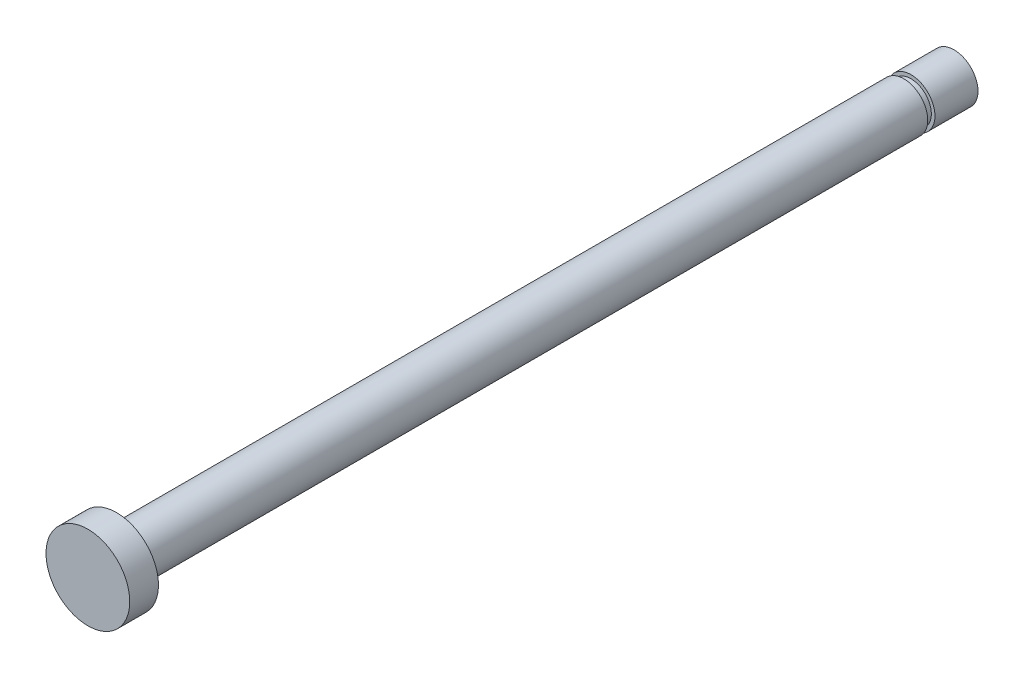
ISO-10303-21;
HEADER;
FILE_DESCRIPTION(('STEP AP214'),'2;1');
FILE_NAME('part.step','',(''),(''),'','','');
FILE_SCHEMA(('AUTOMOTIVE_DESIGN { 1 0 10303 214 1 1 1 1 }'));
ENDSEC;
DATA;
#1=APPLICATION_CONTEXT('core data for automotive mechanical design processes');
#2=APPLICATION_PROTOCOL_DEFINITION('international standard','automotive_design',2000,#1);
#3=PRODUCT_CONTEXT('',#1,'mechanical');
#4=PRODUCT('Part','Part','',(#3));
#5=PRODUCT_RELATED_PRODUCT_CATEGORY('part','',(#4));
#6=PRODUCT_DEFINITION_FORMATION('','',#4);
#7=PRODUCT_DEFINITION_CONTEXT('part definition',#1,'design');
#8=PRODUCT_DEFINITION('design','',#6,#7);
#9=PRODUCT_DEFINITION_SHAPE('','',#8);
#10=(LENGTH_UNIT() NAMED_UNIT(*) SI_UNIT(.MILLI.,.METRE.));
#11=(NAMED_UNIT(*) PLANE_ANGLE_UNIT() SI_UNIT($,.RADIAN.));
#12=(NAMED_UNIT(*) SI_UNIT($,.STERADIAN.) SOLID_ANGLE_UNIT());
#13=UNCERTAINTY_MEASURE_WITH_UNIT(LENGTH_MEASURE(1.E-05),#10,'distance_accuracy_value','');
#14=(GEOMETRIC_REPRESENTATION_CONTEXT(3) GLOBAL_UNCERTAINTY_ASSIGNED_CONTEXT((#13)) GLOBAL_UNIT_ASSIGNED_CONTEXT((#10,
#11,#12)) REPRESENTATION_CONTEXT('',''));
#15=CARTESIAN_POINT('',(0.,0.,0.));
#16=DIRECTION('',(0.,0.,1.));
#17=DIRECTION('',(1.,0.,0.));
#18=AXIS2_PLACEMENT_3D('',#15,#16,#17);
#19=CARTESIAN_POINT('',(0.,0.,-18.1));
#20=DIRECTION('',(0.,0.,-1.));
#21=DIRECTION('',(-1.,0.,0.));
#22=AXIS2_PLACEMENT_3D('',#19,#20,#21);
#23=PLANE('',#22);
#24=CARTESIAN_POINT('',(0.,0.,-18.1));
#25=DIRECTION('',(0.,0.,1.));
#26=DIRECTION('',(1.,0.,0.));
#27=AXIS2_PLACEMENT_3D('',#24,#25,#26);
#28=CIRCLE('',#27,1.);
#29=CARTESIAN_POINT('',(1.,0.,-18.1));
#30=VERTEX_POINT('',#29);
#31=EDGE_CURVE('E18',#30,#30,#28,.T.);
#32=ORIENTED_EDGE('',*,*,#31,.F.);
#33=EDGE_LOOP('',(#32));
#34=FACE_BOUND('',#33,.T.);
#35=ADVANCED_FACE('F15',(#34),#23,.T.);
#36=CARTESIAN_POINT('',(0.,0.,18.1));
#37=DIRECTION('',(0.,0.,1.));
#38=DIRECTION('',(1.,0.,0.));
#39=AXIS2_PLACEMENT_3D('',#36,#37,#38);
#40=CYLINDRICAL_SURFACE('',#39,1.);
#41=CARTESIAN_POINT('',(0.,0.,-16.3));
#42=DIRECTION('',(0.,0.,1.));
#43=DIRECTION('',(1.,0.,0.));
#44=AXIS2_PLACEMENT_3D('',#41,#42,#43);
#45=CIRCLE('',#44,1.);
#46=CARTESIAN_POINT('',(1.,0.,-16.3));
#47=VERTEX_POINT('',#46);
#48=EDGE_CURVE('E40',#47,#47,#45,.T.);
#49=ORIENTED_EDGE('',*,*,#48,.F.);
#50=EDGE_LOOP('',(#49));
#51=FACE_BOUND('',#50,.T.);
#52=ORIENTED_EDGE('',*,*,#31,.T.);
#53=EDGE_LOOP('',(#52));
#54=FACE_BOUND('',#53,.T.);
#55=ADVANCED_FACE('F47',(#51,#54),#40,.T.);
#56=CARTESIAN_POINT('',(0.,0.,-16.3));
#57=DIRECTION('',(0.,0.,1.));
#58=DIRECTION('',(1.,0.,0.));
#59=AXIS2_PLACEMENT_3D('',#56,#57,#58);
#60=PLANE('',#59);
#61=CARTESIAN_POINT('',(0.,0.,-16.3));
#62=DIRECTION('',(0.,0.,-1.));
#63=DIRECTION('',(-1.,0.,0.));
#64=AXIS2_PLACEMENT_3D('',#61,#62,#63);
#65=CIRCLE('',#64,0.85);
#66=CARTESIAN_POINT('',(-0.85,0.,-16.3));
#67=VERTEX_POINT('',#66);
#68=EDGE_CURVE('E38',#67,#67,#65,.F.);
#69=ORIENTED_EDGE('',*,*,#68,.F.);
#70=EDGE_LOOP('',(#69));
#71=FACE_BOUND('',#70,.T.);
#72=ORIENTED_EDGE('',*,*,#48,.T.);
#73=EDGE_LOOP('',(#72));
#74=FACE_BOUND('',#73,.T.);
#75=ADVANCED_FACE('F54',(#71,#74),#60,.T.);
#76=CARTESIAN_POINT('',(0.,0.,18.1));
#77=DIRECTION('',(0.,0.,-1.));
#78=DIRECTION('',(-1.,0.,0.));
#79=AXIS2_PLACEMENT_3D('',#76,#77,#78);
#80=PLANE('',#79);
#81=CARTESIAN_POINT('',(0.,0.,18.1));
#82=DIRECTION('',(0.,0.,-1.));
#83=DIRECTION('',(-1.,0.,0.));
#84=AXIS2_PLACEMENT_3D('',#81,#82,#83);
#85=CIRCLE('',#84,1.75);
#86=CARTESIAN_POINT('',(-1.75,0.,18.1));
#87=VERTEX_POINT('',#86);
#88=EDGE_CURVE('E35',#87,#87,#85,.T.);
#89=ORIENTED_EDGE('',*,*,#88,.F.);
#90=EDGE_LOOP('',(#89));
#91=FACE_BOUND('',#90,.T.);
#92=ADVANCED_FACE('F78',(#91),#80,.F.);
#93=CARTESIAN_POINT('',(0.,0.,-16.8));
#94=DIRECTION('',(0.,0.,-1.));
#95=DIRECTION('',(-1.,0.,0.));
#96=AXIS2_PLACEMENT_3D('',#93,#94,#95);
#97=CYLINDRICAL_SURFACE('',#96,0.85);
#98=CARTESIAN_POINT('',(0.,0.,-16.));
#99=DIRECTION('',(0.,0.,-1.));
#100=DIRECTION('',(-1.,0.,0.));
#101=AXIS2_PLACEMENT_3D('',#98,#99,#100);
#102=CIRCLE('',#101,0.85);
#103=CARTESIAN_POINT('',(-0.85,0.,-16.));
#104=VERTEX_POINT('',#103);
#105=EDGE_CURVE('E32',#104,#104,#102,.T.);
#106=ORIENTED_EDGE('',*,*,#105,.T.);
#107=EDGE_LOOP('',(#106));
#108=FACE_BOUND('',#107,.T.);
#109=ORIENTED_EDGE('',*,*,#68,.T.);
#110=EDGE_LOOP('',(#109));
#111=FACE_BOUND('',#110,.T.);
#112=ADVANCED_FACE('F74',(#108,#111),#97,.T.);
#113=CARTESIAN_POINT('',(0.,0.,16.9));
#114=DIRECTION('',(0.,0.,-1.));
#115=DIRECTION('',(-1.,0.,0.));
#116=AXIS2_PLACEMENT_3D('',#113,#114,#115);
#117=CYLINDRICAL_SURFACE('',#116,1.75);
#118=ORIENTED_EDGE('',*,*,#88,.T.);
#119=EDGE_LOOP('',(#118));
#120=FACE_BOUND('',#119,.T.);
#121=CARTESIAN_POINT('',(0.,0.,16.9));
#122=DIRECTION('',(0.,0.,-1.));
#123=DIRECTION('',(-1.,0.,0.));
#124=AXIS2_PLACEMENT_3D('',#121,#122,#123);
#125=CIRCLE('',#124,1.75);
#126=CARTESIAN_POINT('',(-1.75,0.,16.9));
#127=VERTEX_POINT('',#126);
#128=EDGE_CURVE('E27',#127,#127,#125,.T.);
#129=ORIENTED_EDGE('',*,*,#128,.F.);
#130=EDGE_LOOP('',(#129));
#131=FACE_BOUND('',#130,.T.);
#132=ADVANCED_FACE('F70',(#120,#131),#117,.T.);
#133=CARTESIAN_POINT('',(0.,0.,-16.));
#134=DIRECTION('',(0.,0.,1.));
#135=DIRECTION('',(1.,0.,0.));
#136=AXIS2_PLACEMENT_3D('',#133,#134,#135);
#137=PLANE('',#136);
#138=ORIENTED_EDGE('',*,*,#105,.F.);
#139=EDGE_LOOP('',(#138));
#140=FACE_BOUND('',#139,.T.);
#141=CARTESIAN_POINT('',(0.,0.,-16.));
#142=DIRECTION('',(0.,0.,1.));
#143=DIRECTION('',(1.,0.,0.));
#144=AXIS2_PLACEMENT_3D('',#141,#142,#143);
#145=CIRCLE('',#144,1.);
#146=CARTESIAN_POINT('',(1.,0.,-16.));
#147=VERTEX_POINT('',#146);
#148=EDGE_CURVE('E22',#147,#147,#145,.T.);
#149=ORIENTED_EDGE('',*,*,#148,.F.);
#150=EDGE_LOOP('',(#149));
#151=FACE_BOUND('',#150,.T.);
#152=ADVANCED_FACE('F63',(#140,#151),#137,.F.);
#153=CARTESIAN_POINT('',(0.,0.,16.9));
#154=DIRECTION('',(0.,0.,-1.));
#155=DIRECTION('',(-1.,0.,0.));
#156=AXIS2_PLACEMENT_3D('',#153,#154,#155);
#157=PLANE('',#156);
#158=ORIENTED_EDGE('',*,*,#128,.T.);
#159=EDGE_LOOP('',(#158));
#160=FACE_BOUND('',#159,.T.);
#161=CARTESIAN_POINT('',(0.,0.,16.9));
#162=DIRECTION('',(0.,0.,1.));
#163=DIRECTION('',(1.,0.,0.));
#164=AXIS2_PLACEMENT_3D('',#161,#162,#163);
#165=CIRCLE('',#164,1.);
#166=CARTESIAN_POINT('',(1.,0.,16.9));
#167=VERTEX_POINT('',#166);
#168=EDGE_CURVE('E10',#167,#167,#165,.F.);
#169=ORIENTED_EDGE('',*,*,#168,.F.);
#170=EDGE_LOOP('',(#169));
#171=FACE_BOUND('',#170,.T.);
#172=ADVANCED_FACE('F58',(#160,#171),#157,.T.);
#173=CARTESIAN_POINT('',(0.,0.,18.1));
#174=DIRECTION('',(0.,0.,1.));
#175=DIRECTION('',(1.,0.,0.));
#176=AXIS2_PLACEMENT_3D('',#173,#174,#175);
#177=CYLINDRICAL_SURFACE('',#176,1.);
#178=ORIENTED_EDGE('',*,*,#168,.T.);
#179=EDGE_LOOP('',(#178));
#180=FACE_BOUND('',#179,.T.);
#181=ORIENTED_EDGE('',*,*,#148,.T.);
#182=EDGE_LOOP('',(#181));
#183=FACE_BOUND('',#182,.T.);
#184=ADVANCED_FACE('F56',(#180,#183),#177,.T.);
#185=CLOSED_SHELL('',(#35,#55,#75,#92,#112,#132,#152,#172,#184));
#186=MANIFOLD_SOLID_BREP('B1',#185);
#187=ADVANCED_BREP_SHAPE_REPRESENTATION('',(#18,#186),#14);
#188=SHAPE_DEFINITION_REPRESENTATION(#9,#187);
ENDSEC;
END-ISO-10303-21;
